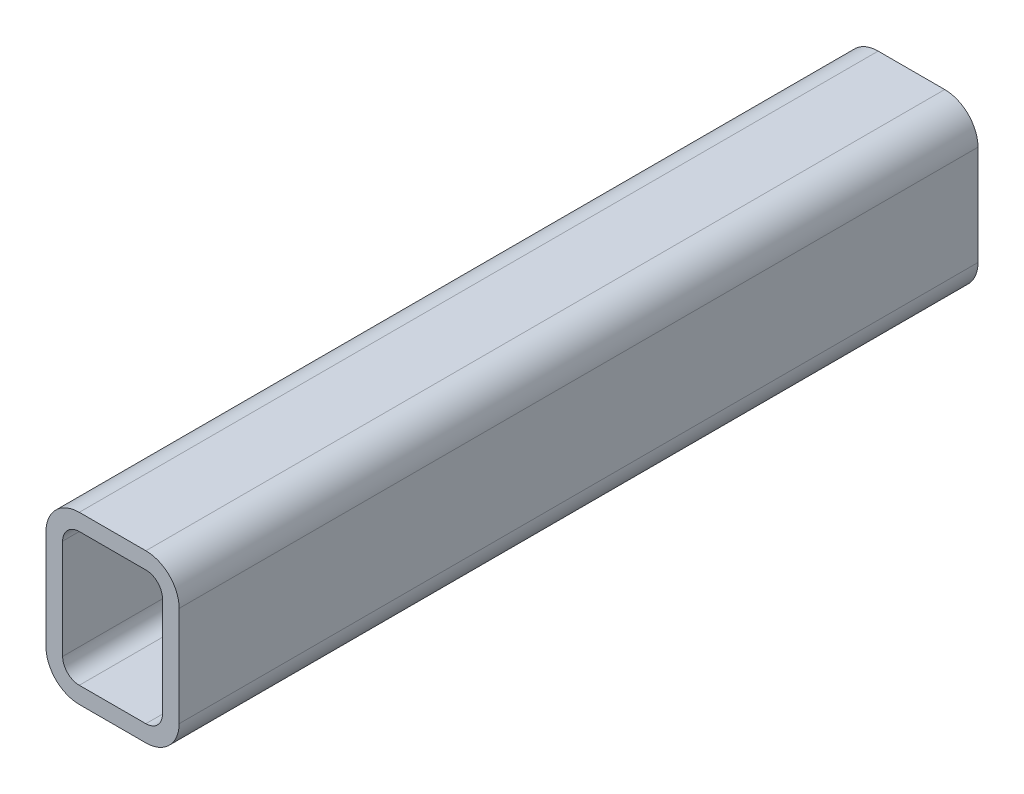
from build123d import *

# Parameters (mm, degrees)
BOSS_EXTRUDE1_DEPTH = 304.8


with BuildPart() as part:
    # Sketch1 → Boss-Extrude1 (new body)
    with BuildSketch(Plane.XY):
        with BuildLine():
            Line((12.7, 63.5), (38.1, 63.5))
            ThreePointArc((38.1, 63.5), (47.080256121, 59.780256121), (50.8, 50.8))
            Line((50.8, 50.8), (50.8, 12.7))
            ThreePointArc((50.8, 12.7), (47.080256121, 3.719743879), (38.1, 0))
            Line((38.1, 0), (12.7, 0))
            ThreePointArc((12.7, 0), (3.719743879, 3.719743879), (0, 12.7))
            Line((0, 12.7), (0, 50.8))
            ThreePointArc((0, 50.8), (3.719743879, 59.780256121), (12.7, 63.5))
        make_face()
        with BuildLine():
            Line((12.7, 57.15), (38.1, 57.15))
            ThreePointArc((38.1, 57.15), (42.590128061, 55.290128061), (44.45, 50.8))
            Line((44.45, 50.8), (44.45, 12.7))
            ThreePointArc((44.45, 12.7), (42.590128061, 8.209871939), (38.1, 6.35))
            Line((38.1, 6.35), (12.7, 6.35))
            ThreePointArc((12.7, 6.35), (8.209871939, 8.209871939), (6.35, 12.7))
            Line((6.35, 12.7), (6.35, 50.8))
            ThreePointArc((6.35, 50.8), (8.209871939, 55.290128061), (12.7, 57.15))
        make_face(mode=Mode.SUBTRACT)
    extrude(amount=BOSS_EXTRUDE1_DEPTH)


solid = part.part
